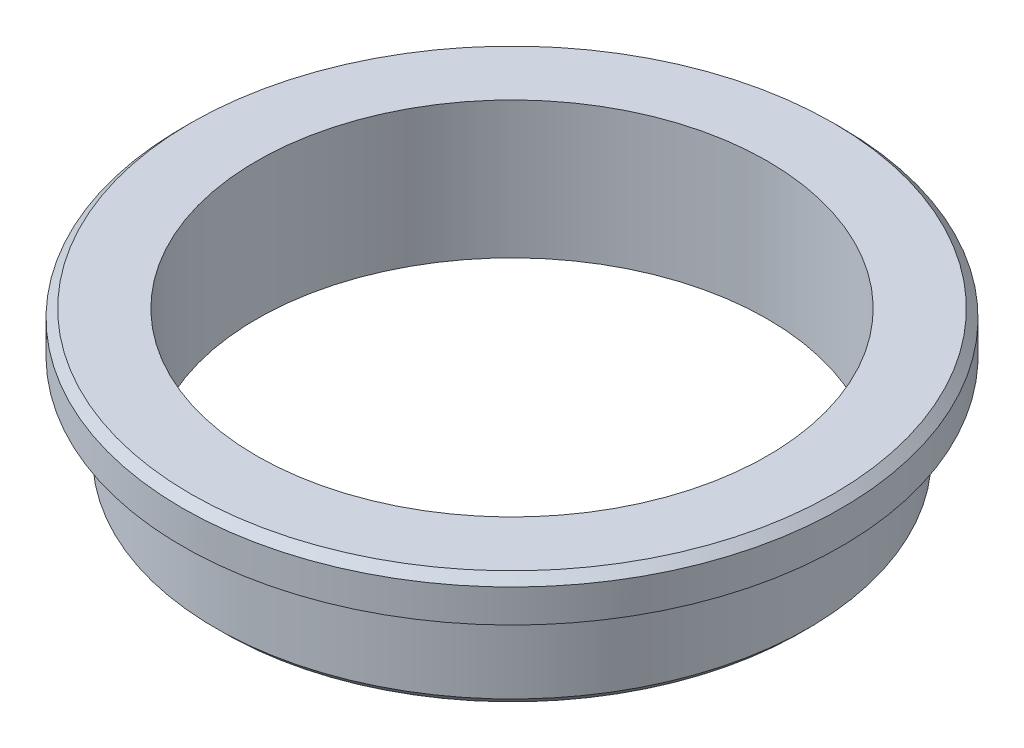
ISO-10303-21;
HEADER;
FILE_DESCRIPTION(('STEP AP214'),'2;1');
FILE_NAME('part.step','',(''),(''),'','','');
FILE_SCHEMA(('AUTOMOTIVE_DESIGN { 1 0 10303 214 1 1 1 1 }'));
ENDSEC;
DATA;
#1=APPLICATION_CONTEXT('core data for automotive mechanical design processes');
#2=APPLICATION_PROTOCOL_DEFINITION('international standard','automotive_design',2000,#1);
#3=PRODUCT_CONTEXT('',#1,'mechanical');
#4=PRODUCT('Part','Part','',(#3));
#5=PRODUCT_RELATED_PRODUCT_CATEGORY('part','',(#4));
#6=PRODUCT_DEFINITION_FORMATION('','',#4);
#7=PRODUCT_DEFINITION_CONTEXT('part definition',#1,'design');
#8=PRODUCT_DEFINITION('design','',#6,#7);
#9=PRODUCT_DEFINITION_SHAPE('','',#8);
#10=(LENGTH_UNIT() NAMED_UNIT(*) SI_UNIT(.MILLI.,.METRE.));
#11=(NAMED_UNIT(*) PLANE_ANGLE_UNIT() SI_UNIT($,.RADIAN.));
#12=(NAMED_UNIT(*) SI_UNIT($,.STERADIAN.) SOLID_ANGLE_UNIT());
#13=UNCERTAINTY_MEASURE_WITH_UNIT(LENGTH_MEASURE(1.E-05),#10,'distance_accuracy_value','');
#14=(GEOMETRIC_REPRESENTATION_CONTEXT(3) GLOBAL_UNCERTAINTY_ASSIGNED_CONTEXT((#13)) GLOBAL_UNIT_ASSIGNED_CONTEXT((#10,
#11,#12)) REPRESENTATION_CONTEXT('',''));
#15=CARTESIAN_POINT('',(0.,0.,0.));
#16=DIRECTION('',(0.,0.,1.));
#17=DIRECTION('',(1.,0.,0.));
#18=AXIS2_PLACEMENT_3D('',#15,#16,#17);
#19=CARTESIAN_POINT('',(0.,0.,0.));
#20=DIRECTION('',(0.,-1.,0.));
#21=DIRECTION('',(0.,0.,-1.));
#22=AXIS2_PLACEMENT_3D('',#19,#20,#21);
#23=CYLINDRICAL_SURFACE('',#22,15.5);
#24=CARTESIAN_POINT('',(0.,-5.8,0.));
#25=DIRECTION('',(0.,-1.,0.));
#26=DIRECTION('',(0.,0.,-1.));
#27=AXIS2_PLACEMENT_3D('',#24,#25,#26);
#28=CIRCLE('',#27,15.5);
#29=CARTESIAN_POINT('',(0.,-5.8,-15.5));
#30=VERTEX_POINT('',#29);
#31=EDGE_CURVE('E60',#30,#30,#28,.T.);
#32=ORIENTED_EDGE('',*,*,#31,.T.);
#33=EDGE_LOOP('',(#32));
#34=FACE_BOUND('',#33,.T.);
#35=CARTESIAN_POINT('',(0.,2.5,0.));
#36=DIRECTION('',(0.,-1.,0.));
#37=DIRECTION('',(0.,0.,-1.));
#38=AXIS2_PLACEMENT_3D('',#35,#36,#37);
#39=CIRCLE('',#38,15.5);
#40=CARTESIAN_POINT('',(0.,2.5,-15.5));
#41=VERTEX_POINT('',#40);
#42=EDGE_CURVE('E51',#41,#41,#39,.T.);
#43=ORIENTED_EDGE('',*,*,#42,.F.);
#44=EDGE_LOOP('',(#43));
#45=FACE_BOUND('',#44,.T.);
#46=ADVANCED_FACE('F32',(#34,#45),#23,.F.);
#47=CARTESIAN_POINT('',(15.5,2.5,0.));
#48=DIRECTION('',(0.,1.,0.));
#49=DIRECTION('',(0.,0.,1.));
#50=AXIS2_PLACEMENT_3D('',#47,#48,#49);
#51=PLANE('',#50);
#52=CARTESIAN_POINT('',(0.,2.5,0.));
#53=DIRECTION('',(0.,1.,0.));
#54=DIRECTION('',(0.,0.,1.));
#55=AXIS2_PLACEMENT_3D('',#52,#53,#54);
#56=CIRCLE('',#55,19.5);
#57=CARTESIAN_POINT('',(0.,2.5,19.5));
#58=VERTEX_POINT('',#57);
#59=EDGE_CURVE('E10',#58,#58,#56,.T.);
#60=ORIENTED_EDGE('',*,*,#59,.T.);
#61=EDGE_LOOP('',(#60));
#62=FACE_BOUND('',#61,.T.);
#63=ORIENTED_EDGE('',*,*,#42,.T.);
#64=EDGE_LOOP('',(#63));
#65=FACE_BOUND('',#64,.T.);
#66=ADVANCED_FACE('F83',(#62,#65),#51,.T.);
#67=CARTESIAN_POINT('',(0.,0.,0.));
#68=DIRECTION('',(0.,-1.,0.));
#69=DIRECTION('',(0.,0.,-1.));
#70=AXIS2_PLACEMENT_3D('',#67,#68,#69);
#71=CYLINDRICAL_SURFACE('',#70,20.);
#72=CARTESIAN_POINT('',(0.,1.99999999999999,0.));
#73=DIRECTION('',(0.,1.,0.));
#74=DIRECTION('',(0.,0.,1.));
#75=AXIS2_PLACEMENT_3D('',#72,#73,#74);
#76=CIRCLE('',#75,20.);
#77=CARTESIAN_POINT('',(0.,1.99999999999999,20.));
#78=VERTEX_POINT('',#77);
#79=EDGE_CURVE('E38',#78,#78,#76,.F.);
#80=ORIENTED_EDGE('',*,*,#79,.T.);
#81=EDGE_LOOP('',(#80));
#82=FACE_BOUND('',#81,.T.);
#83=CARTESIAN_POINT('',(0.,0.,0.));
#84=DIRECTION('',(0.,-1.,0.));
#85=DIRECTION('',(0.,0.,-1.));
#86=AXIS2_PLACEMENT_3D('',#83,#84,#85);
#87=CIRCLE('',#86,20.);
#88=CARTESIAN_POINT('',(0.,0.,-20.));
#89=VERTEX_POINT('',#88);
#90=EDGE_CURVE('E54',#89,#89,#87,.T.);
#91=ORIENTED_EDGE('',*,*,#90,.F.);
#92=EDGE_LOOP('',(#91));
#93=FACE_BOUND('',#92,.T.);
#94=ADVANCED_FACE('F87',(#82,#93),#71,.T.);
#95=CARTESIAN_POINT('',(20.,0.,0.));
#96=DIRECTION('',(0.,-1.,0.));
#97=DIRECTION('',(0.,0.,-1.));
#98=AXIS2_PLACEMENT_3D('',#95,#96,#97);
#99=PLANE('',#98);
#100=ORIENTED_EDGE('',*,*,#90,.T.);
#101=EDGE_LOOP('',(#100));
#102=FACE_BOUND('',#101,.T.);
#103=CARTESIAN_POINT('',(0.,0.,0.));
#104=DIRECTION('',(0.,-1.,0.));
#105=DIRECTION('',(0.,0.,-1.));
#106=AXIS2_PLACEMENT_3D('',#103,#104,#105);
#107=CIRCLE('',#106,18.);
#108=CARTESIAN_POINT('',(0.,0.,-18.));
#109=VERTEX_POINT('',#108);
#110=EDGE_CURVE('E57',#109,#109,#107,.T.);
#111=ORIENTED_EDGE('',*,*,#110,.F.);
#112=EDGE_LOOP('',(#111));
#113=FACE_BOUND('',#112,.T.);
#114=ADVANCED_FACE('F79',(#102,#113),#99,.T.);
#115=CARTESIAN_POINT('',(0.,0.,0.));
#116=DIRECTION('',(0.,-1.,0.));
#117=DIRECTION('',(0.,0.,-1.));
#118=AXIS2_PLACEMENT_3D('',#115,#116,#117);
#119=CYLINDRICAL_SURFACE('',#118,18.);
#120=CARTESIAN_POINT('',(0.,-5.3,0.));
#121=DIRECTION('',(0.,-1.,0.));
#122=DIRECTION('',(0.,0.,-1.));
#123=AXIS2_PLACEMENT_3D('',#120,#121,#122);
#124=CIRCLE('',#123,18.);
#125=CARTESIAN_POINT('',(0.,-5.3,-18.));
#126=VERTEX_POINT('',#125);
#127=EDGE_CURVE('E42',#126,#126,#124,.F.);
#128=ORIENTED_EDGE('',*,*,#127,.T.);
#129=EDGE_LOOP('',(#128));
#130=FACE_BOUND('',#129,.T.);
#131=ORIENTED_EDGE('',*,*,#110,.T.);
#132=EDGE_LOOP('',(#131));
#133=FACE_BOUND('',#132,.T.);
#134=ADVANCED_FACE('F69',(#130,#133),#119,.T.);
#135=CARTESIAN_POINT('',(18.,-5.8,0.));
#136=DIRECTION('',(0.,-1.,0.));
#137=DIRECTION('',(0.,0.,-1.));
#138=AXIS2_PLACEMENT_3D('',#135,#136,#137);
#139=PLANE('',#138);
#140=CARTESIAN_POINT('',(0.,-5.8,0.));
#141=DIRECTION('',(0.,-1.,0.));
#142=DIRECTION('',(0.,0.,-1.));
#143=AXIS2_PLACEMENT_3D('',#140,#141,#142);
#144=CIRCLE('',#143,17.5);
#145=CARTESIAN_POINT('',(0.,-5.8,-17.5));
#146=VERTEX_POINT('',#145);
#147=EDGE_CURVE('E46',#146,#146,#144,.T.);
#148=ORIENTED_EDGE('',*,*,#147,.T.);
#149=EDGE_LOOP('',(#148));
#150=FACE_BOUND('',#149,.T.);
#151=ORIENTED_EDGE('',*,*,#31,.F.);
#152=EDGE_LOOP('',(#151));
#153=FACE_BOUND('',#152,.T.);
#154=ADVANCED_FACE('F66',(#150,#153),#139,.T.);
#155=CARTESIAN_POINT('',(0.,-5.8,0.));
#156=DIRECTION('',(0.,1.,0.));
#157=DIRECTION('',(0.,0.,1.));
#158=AXIS2_PLACEMENT_3D('',#155,#156,#157);
#159=CONICAL_SURFACE('',#158,17.5,0.785398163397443);
#160=ORIENTED_EDGE('',*,*,#127,.F.);
#161=EDGE_LOOP('',(#160));
#162=FACE_BOUND('',#161,.T.);
#163=ORIENTED_EDGE('',*,*,#147,.F.);
#164=EDGE_LOOP('',(#163));
#165=FACE_BOUND('',#164,.T.);
#166=ADVANCED_FACE('F68',(#162,#165),#159,.T.);
#167=CARTESIAN_POINT('',(0.,1.99999999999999,0.));
#168=DIRECTION('',(0.,-1.,0.));
#169=DIRECTION('',(0.,0.,-1.));
#170=AXIS2_PLACEMENT_3D('',#167,#168,#169);
#171=CONICAL_SURFACE('',#170,20.,0.785398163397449);
#172=ORIENTED_EDGE('',*,*,#59,.F.);
#173=EDGE_LOOP('',(#172));
#174=FACE_BOUND('',#173,.T.);
#175=ORIENTED_EDGE('',*,*,#79,.F.);
#176=EDGE_LOOP('',(#175));
#177=FACE_BOUND('',#176,.T.);
#178=ADVANCED_FACE('F76',(#174,#177),#171,.T.);
#179=CLOSED_SHELL('',(#46,#66,#94,#114,#134,#154,#166,#178));
#180=MANIFOLD_SOLID_BREP('B2',#179);
#181=ADVANCED_BREP_SHAPE_REPRESENTATION('',(#18,#180),#14);
#182=SHAPE_DEFINITION_REPRESENTATION(#9,#181);
ENDSEC;
END-ISO-10303-21;
